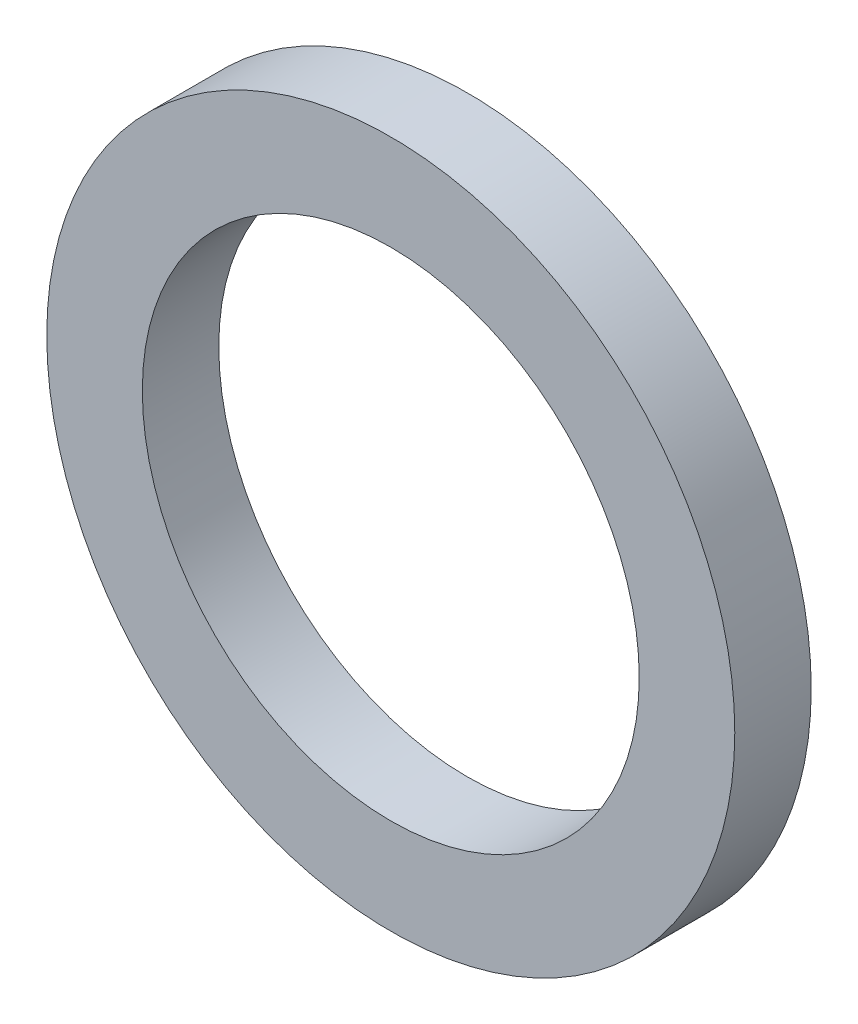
ISO-10303-21;
HEADER;
FILE_DESCRIPTION(('STEP AP214'),'2;1');
FILE_NAME('part.step','',(''),(''),'','','');
FILE_SCHEMA(('AUTOMOTIVE_DESIGN { 1 0 10303 214 1 1 1 1 }'));
ENDSEC;
DATA;
#1=APPLICATION_CONTEXT('core data for automotive mechanical design processes');
#2=APPLICATION_PROTOCOL_DEFINITION('international standard','automotive_design',2000,#1);
#3=PRODUCT_CONTEXT('',#1,'mechanical');
#4=PRODUCT('Part','Part','',(#3));
#5=PRODUCT_RELATED_PRODUCT_CATEGORY('part','',(#4));
#6=PRODUCT_DEFINITION_FORMATION('','',#4);
#7=PRODUCT_DEFINITION_CONTEXT('part definition',#1,'design');
#8=PRODUCT_DEFINITION('design','',#6,#7);
#9=PRODUCT_DEFINITION_SHAPE('','',#8);
#10=(LENGTH_UNIT() NAMED_UNIT(*) SI_UNIT(.MILLI.,.METRE.));
#11=(NAMED_UNIT(*) PLANE_ANGLE_UNIT() SI_UNIT($,.RADIAN.));
#12=(NAMED_UNIT(*) SI_UNIT($,.STERADIAN.) SOLID_ANGLE_UNIT());
#13=UNCERTAINTY_MEASURE_WITH_UNIT(LENGTH_MEASURE(1.E-05),#10,'distance_accuracy_value','');
#14=(GEOMETRIC_REPRESENTATION_CONTEXT(3) GLOBAL_UNCERTAINTY_ASSIGNED_CONTEXT((#13)) GLOBAL_UNIT_ASSIGNED_CONTEXT((#10,
#11,#12)) REPRESENTATION_CONTEXT('',''));
#15=CARTESIAN_POINT('',(0.,0.,0.));
#16=DIRECTION('',(0.,0.,1.));
#17=DIRECTION('',(1.,0.,0.));
#18=AXIS2_PLACEMENT_3D('',#15,#16,#17);
#19=CARTESIAN_POINT('',(0.,-6.5,-17.05));
#20=DIRECTION('',(0.,0.,-1.));
#21=DIRECTION('',(-1.,0.,0.));
#22=AXIS2_PLACEMENT_3D('',#19,#20,#21);
#23=PLANE('',#22);
#24=CARTESIAN_POINT('',(0.,0.,-17.05));
#25=DIRECTION('',(0.,0.,1.));
#26=DIRECTION('',(1.,0.,0.));
#27=AXIS2_PLACEMENT_3D('',#24,#25,#26);
#28=CIRCLE('',#27,6.5);
#29=CARTESIAN_POINT('',(6.5,0.,-17.05));
#30=VERTEX_POINT('',#29);
#31=EDGE_CURVE('E27',#30,#30,#28,.T.);
#32=ORIENTED_EDGE('',*,*,#31,.T.);
#33=EDGE_LOOP('',(#32));
#34=FACE_BOUND('',#33,.T.);
#35=CARTESIAN_POINT('',(0.,0.,-17.05));
#36=DIRECTION('',(0.,0.,1.));
#37=DIRECTION('',(1.,0.,0.));
#38=AXIS2_PLACEMENT_3D('',#35,#36,#37);
#39=CIRCLE('',#38,9.);
#40=CARTESIAN_POINT('',(9.,0.,-17.05));
#41=VERTEX_POINT('',#40);
#42=EDGE_CURVE('E18',#41,#41,#39,.T.);
#43=ORIENTED_EDGE('',*,*,#42,.F.);
#44=EDGE_LOOP('',(#43));
#45=FACE_BOUND('',#44,.T.);
#46=ADVANCED_FACE('F15',(#34,#45),#23,.T.);
#47=CARTESIAN_POINT('',(0.,0.,-15.05));
#48=DIRECTION('',(0.,0.,1.));
#49=DIRECTION('',(1.,0.,0.));
#50=AXIS2_PLACEMENT_3D('',#47,#48,#49);
#51=CYLINDRICAL_SURFACE('',#50,9.);
#52=ORIENTED_EDGE('',*,*,#42,.T.);
#53=EDGE_LOOP('',(#52));
#54=FACE_BOUND('',#53,.T.);
#55=CARTESIAN_POINT('',(0.,0.,-15.05));
#56=DIRECTION('',(0.,0.,1.));
#57=DIRECTION('',(1.,0.,0.));
#58=AXIS2_PLACEMENT_3D('',#55,#56,#57);
#59=CIRCLE('',#58,9.);
#60=CARTESIAN_POINT('',(9.,0.,-15.05));
#61=VERTEX_POINT('',#60);
#62=EDGE_CURVE('E22',#61,#61,#59,.T.);
#63=ORIENTED_EDGE('',*,*,#62,.F.);
#64=EDGE_LOOP('',(#63));
#65=FACE_BOUND('',#64,.T.);
#66=ADVANCED_FACE('F35',(#54,#65),#51,.T.);
#67=CARTESIAN_POINT('',(0.,0.,-15.05));
#68=DIRECTION('',(0.,0.,1.));
#69=DIRECTION('',(1.,0.,0.));
#70=AXIS2_PLACEMENT_3D('',#67,#68,#69);
#71=CYLINDRICAL_SURFACE('',#70,6.5);
#72=CARTESIAN_POINT('',(0.,0.,-15.05));
#73=DIRECTION('',(0.,0.,1.));
#74=DIRECTION('',(1.,0.,0.));
#75=AXIS2_PLACEMENT_3D('',#72,#73,#74);
#76=CIRCLE('',#75,6.5);
#77=CARTESIAN_POINT('',(6.5,0.,-15.05));
#78=VERTEX_POINT('',#77);
#79=EDGE_CURVE('E10',#78,#78,#76,.F.);
#80=ORIENTED_EDGE('',*,*,#79,.F.);
#81=EDGE_LOOP('',(#80));
#82=FACE_BOUND('',#81,.T.);
#83=ORIENTED_EDGE('',*,*,#31,.F.);
#84=EDGE_LOOP('',(#83));
#85=FACE_BOUND('',#84,.T.);
#86=ADVANCED_FACE('F43',(#82,#85),#71,.F.);
#87=CARTESIAN_POINT('',(0.,-9.,-15.05));
#88=DIRECTION('',(0.,0.,1.));
#89=DIRECTION('',(1.,0.,0.));
#90=AXIS2_PLACEMENT_3D('',#87,#88,#89);
#91=PLANE('',#90);
#92=ORIENTED_EDGE('',*,*,#79,.T.);
#93=EDGE_LOOP('',(#92));
#94=FACE_BOUND('',#93,.T.);
#95=ORIENTED_EDGE('',*,*,#62,.T.);
#96=EDGE_LOOP('',(#95));
#97=FACE_BOUND('',#96,.T.);
#98=ADVANCED_FACE('F44',(#94,#97),#91,.T.);
#99=CLOSED_SHELL('',(#46,#66,#86,#98));
#100=MANIFOLD_SOLID_BREP('B1',#99);
#101=ADVANCED_BREP_SHAPE_REPRESENTATION('',(#18,#100),#14);
#102=SHAPE_DEFINITION_REPRESENTATION(#9,#101);
ENDSEC;
END-ISO-10303-21;
